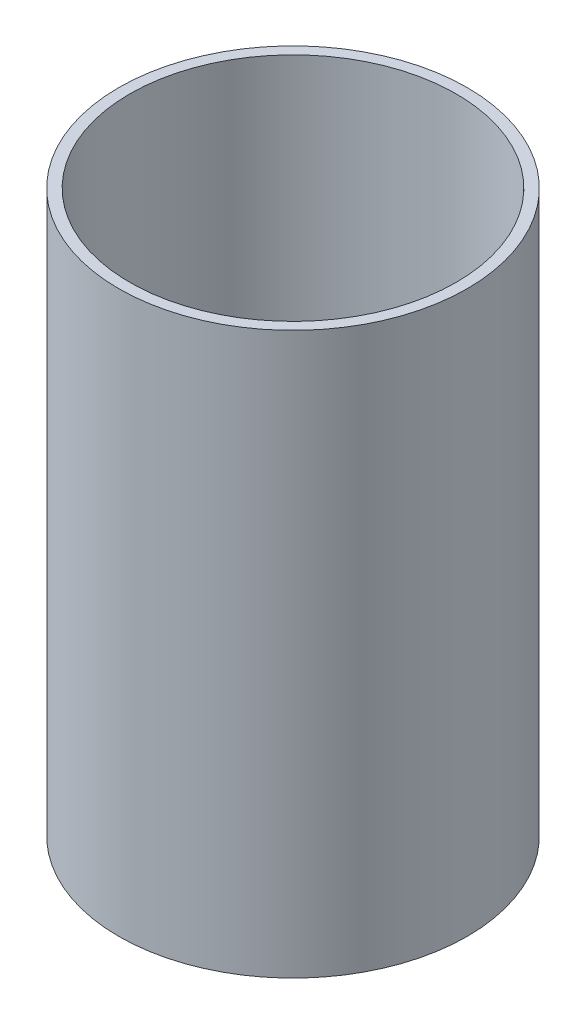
ISO-10303-21;
HEADER;
FILE_DESCRIPTION(('STEP AP214'),'2;1');
FILE_NAME('part.step','',(''),(''),'','','');
FILE_SCHEMA(('AUTOMOTIVE_DESIGN { 1 0 10303 214 1 1 1 1 }'));
ENDSEC;
DATA;
#1=APPLICATION_CONTEXT('core data for automotive mechanical design processes');
#2=APPLICATION_PROTOCOL_DEFINITION('international standard','automotive_design',2000,#1);
#3=PRODUCT_CONTEXT('',#1,'mechanical');
#4=PRODUCT('Part','Part','',(#3));
#5=PRODUCT_RELATED_PRODUCT_CATEGORY('part','',(#4));
#6=PRODUCT_DEFINITION_FORMATION('','',#4);
#7=PRODUCT_DEFINITION_CONTEXT('part definition',#1,'design');
#8=PRODUCT_DEFINITION('design','',#6,#7);
#9=PRODUCT_DEFINITION_SHAPE('','',#8);
#10=(LENGTH_UNIT() NAMED_UNIT(*) SI_UNIT(.MILLI.,.METRE.));
#11=(NAMED_UNIT(*) PLANE_ANGLE_UNIT() SI_UNIT($,.RADIAN.));
#12=(NAMED_UNIT(*) SI_UNIT($,.STERADIAN.) SOLID_ANGLE_UNIT());
#13=UNCERTAINTY_MEASURE_WITH_UNIT(LENGTH_MEASURE(1.E-05),#10,'distance_accuracy_value','');
#14=(GEOMETRIC_REPRESENTATION_CONTEXT(3) GLOBAL_UNCERTAINTY_ASSIGNED_CONTEXT((#13)) GLOBAL_UNIT_ASSIGNED_CONTEXT((#10,
#11,#12)) REPRESENTATION_CONTEXT('',''));
#15=CARTESIAN_POINT('',(0.,0.,0.));
#16=DIRECTION('',(0.,0.,1.));
#17=DIRECTION('',(1.,0.,0.));
#18=AXIS2_PLACEMENT_3D('',#15,#16,#17);
#19=CARTESIAN_POINT('',(0.,256.,0.));
#20=DIRECTION('',(0.,1.,0.));
#21=DIRECTION('',(0.,0.,1.));
#22=AXIS2_PLACEMENT_3D('',#19,#20,#21);
#23=PLANE('',#22);
#24=CARTESIAN_POINT('',(0.,256.,0.));
#25=DIRECTION('',(0.,1.,0.));
#26=DIRECTION('',(0.,0.,1.));
#27=AXIS2_PLACEMENT_3D('',#24,#25,#26);
#28=CIRCLE('',#27,79.5);
#29=CARTESIAN_POINT('',(0.,256.,79.5000000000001));
#30=VERTEX_POINT('',#29);
#31=EDGE_CURVE('E13',#30,#30,#28,.T.);
#32=ORIENTED_EDGE('',*,*,#31,.T.);
#33=EDGE_LOOP('',(#32));
#34=FACE_BOUND('',#33,.T.);
#35=CARTESIAN_POINT('',(0.,256.,0.));
#36=DIRECTION('',(0.,1.,0.));
#37=DIRECTION('',(1.,0.,0.));
#38=AXIS2_PLACEMENT_3D('',#35,#36,#37);
#39=CIRCLE('',#38,74.5);
#40=CARTESIAN_POINT('',(74.5000000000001,256.,0.));
#41=VERTEX_POINT('',#40);
#42=EDGE_CURVE('E55',#41,#41,#39,.T.);
#43=ORIENTED_EDGE('',*,*,#42,.F.);
#44=EDGE_LOOP('',(#43));
#45=FACE_BOUND('',#44,.T.);
#46=ADVANCED_FACE('F44',(#34,#45),#23,.T.);
#47=CARTESIAN_POINT('',(0.,0.,0.));
#48=DIRECTION('',(0.,1.,0.));
#49=DIRECTION('',(0.,0.,1.));
#50=AXIS2_PLACEMENT_3D('',#47,#48,#49);
#51=PLANE('',#50);
#52=CARTESIAN_POINT('',(0.,0.,0.));
#53=DIRECTION('',(0.,1.,0.));
#54=DIRECTION('',(0.,0.,1.));
#55=AXIS2_PLACEMENT_3D('',#52,#53,#54);
#56=CIRCLE('',#55,79.5);
#57=CARTESIAN_POINT('',(0.,0.,79.5000000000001));
#58=VERTEX_POINT('',#57);
#59=EDGE_CURVE('E48',#58,#58,#56,.T.);
#60=ORIENTED_EDGE('',*,*,#59,.F.);
#61=EDGE_LOOP('',(#60));
#62=FACE_BOUND('',#61,.T.);
#63=CARTESIAN_POINT('',(0.,0.,0.));
#64=DIRECTION('',(0.,1.,0.));
#65=DIRECTION('',(1.,0.,0.));
#66=AXIS2_PLACEMENT_3D('',#63,#64,#65);
#67=CIRCLE('',#66,74.5);
#68=CARTESIAN_POINT('',(74.5000000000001,0.,0.));
#69=VERTEX_POINT('',#68);
#70=EDGE_CURVE('E57',#69,#69,#67,.T.);
#71=ORIENTED_EDGE('',*,*,#70,.T.);
#72=EDGE_LOOP('',(#71));
#73=FACE_BOUND('',#72,.T.);
#74=ADVANCED_FACE('F67',(#62,#73),#51,.F.);
#75=CARTESIAN_POINT('',(0.,256.,0.));
#76=DIRECTION('',(0.,-1.,0.));
#77=DIRECTION('',(0.,0.,-1.));
#78=AXIS2_PLACEMENT_3D('',#75,#76,#77);
#79=CYLINDRICAL_SURFACE('',#78,79.5);
#80=ORIENTED_EDGE('',*,*,#31,.F.);
#81=EDGE_LOOP('',(#80));
#82=FACE_BOUND('',#81,.T.);
#83=ORIENTED_EDGE('',*,*,#59,.T.);
#84=EDGE_LOOP('',(#83));
#85=FACE_BOUND('',#84,.T.);
#86=ADVANCED_FACE('F46',(#82,#85),#79,.T.);
#87=CARTESIAN_POINT('',(0.,256.,0.));
#88=DIRECTION('',(0.,-1.,0.));
#89=DIRECTION('',(0.,0.,-1.));
#90=AXIS2_PLACEMENT_3D('',#87,#88,#89);
#91=CYLINDRICAL_SURFACE('',#90,74.5);
#92=ORIENTED_EDGE('',*,*,#42,.T.);
#93=EDGE_LOOP('',(#92));
#94=FACE_BOUND('',#93,.T.);
#95=ORIENTED_EDGE('',*,*,#70,.F.);
#96=EDGE_LOOP('',(#95));
#97=FACE_BOUND('',#96,.T.);
#98=ADVANCED_FACE('F63',(#94,#97),#91,.F.);
#99=CLOSED_SHELL('',(#46,#74,#86,#98));
#100=MANIFOLD_SOLID_BREP('B2',#99);
#101=ADVANCED_BREP_SHAPE_REPRESENTATION('',(#18,#100),#14);
#102=SHAPE_DEFINITION_REPRESENTATION(#9,#101);
ENDSEC;
END-ISO-10303-21;
